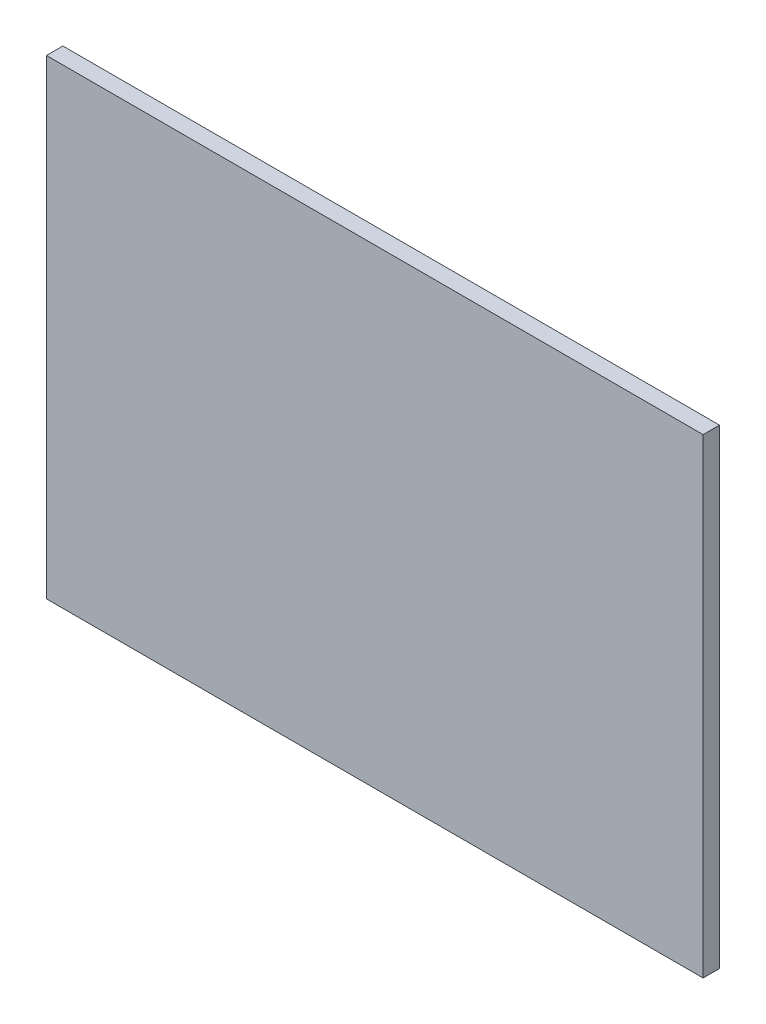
ISO-10303-21;
HEADER;
FILE_DESCRIPTION(('STEP AP214'),'2;1');
FILE_NAME('part.step','',(''),(''),'','','');
FILE_SCHEMA(('AUTOMOTIVE_DESIGN { 1 0 10303 214 1 1 1 1 }'));
ENDSEC;
DATA;
#1=APPLICATION_CONTEXT('core data for automotive mechanical design processes');
#2=APPLICATION_PROTOCOL_DEFINITION('international standard','automotive_design',2000,#1);
#3=PRODUCT_CONTEXT('',#1,'mechanical');
#4=PRODUCT('Part','Part','',(#3));
#5=PRODUCT_RELATED_PRODUCT_CATEGORY('part','',(#4));
#6=PRODUCT_DEFINITION_FORMATION('','',#4);
#7=PRODUCT_DEFINITION_CONTEXT('part definition',#1,'design');
#8=PRODUCT_DEFINITION('design','',#6,#7);
#9=PRODUCT_DEFINITION_SHAPE('','',#8);
#10=(LENGTH_UNIT() NAMED_UNIT(*) SI_UNIT(.MILLI.,.METRE.));
#11=(NAMED_UNIT(*) PLANE_ANGLE_UNIT() SI_UNIT($,.RADIAN.));
#12=(NAMED_UNIT(*) SI_UNIT($,.STERADIAN.) SOLID_ANGLE_UNIT());
#13=UNCERTAINTY_MEASURE_WITH_UNIT(LENGTH_MEASURE(1.E-05),#10,'distance_accuracy_value','');
#14=(GEOMETRIC_REPRESENTATION_CONTEXT(3) GLOBAL_UNCERTAINTY_ASSIGNED_CONTEXT((#13)) GLOBAL_UNIT_ASSIGNED_CONTEXT((#10,
#11,#12)) REPRESENTATION_CONTEXT('',''));
#15=CARTESIAN_POINT('',(0.,0.,0.));
#16=DIRECTION('',(0.,0.,1.));
#17=DIRECTION('',(1.,0.,0.));
#18=AXIS2_PLACEMENT_3D('',#15,#16,#17);
#19=CARTESIAN_POINT('',(300.,215.,15.));
#20=DIRECTION('',(-1.,0.,0.));
#21=DIRECTION('',(0.,-1.,0.));
#22=AXIS2_PLACEMENT_3D('',#19,#20,#21);
#23=PLANE('',#22);
#24=DIRECTION('',(0.,1.,0.));
#25=VECTOR('',#24,1.);
#26=CARTESIAN_POINT('',(300.,215.,0.));
#27=LINE('',#26,#25);
#28=CARTESIAN_POINT('',(300.,-215.,0.));
#29=VERTEX_POINT('',#28);
#30=CARTESIAN_POINT('',(300.,215.,0.));
#31=VERTEX_POINT('',#30);
#32=EDGE_CURVE('E111',#29,#31,#27,.T.);
#33=ORIENTED_EDGE('',*,*,#32,.T.);
#34=DIRECTION('',(0.,0.,-1.));
#35=VECTOR('',#34,1.);
#36=CARTESIAN_POINT('',(300.,215.,15.));
#37=LINE('',#36,#35);
#38=CARTESIAN_POINT('',(300.,215.,15.));
#39=VERTEX_POINT('',#38);
#40=EDGE_CURVE('E11',#39,#31,#37,.T.);
#41=ORIENTED_EDGE('',*,*,#40,.F.);
#42=DIRECTION('',(0.,1.,0.));
#43=VECTOR('',#42,1.);
#44=CARTESIAN_POINT('',(300.,215.,15.));
#45=LINE('',#44,#43);
#46=CARTESIAN_POINT('',(300.,-215.,15.));
#47=VERTEX_POINT('',#46);
#48=EDGE_CURVE('E95',#47,#39,#45,.T.);
#49=ORIENTED_EDGE('',*,*,#48,.F.);
#50=DIRECTION('',(0.,0.,-1.));
#51=VECTOR('',#50,1.);
#52=CARTESIAN_POINT('',(300.,-215.,15.));
#53=LINE('',#52,#51);
#54=EDGE_CURVE('E107',#47,#29,#53,.T.);
#55=ORIENTED_EDGE('',*,*,#54,.T.);
#56=EDGE_LOOP('',(#33,#41,#49,#55));
#57=FACE_BOUND('',#56,.T.);
#58=ADVANCED_FACE('F43',(#57),#23,.F.);
#59=CARTESIAN_POINT('',(-300.,215.,15.));
#60=DIRECTION('',(0.,-1.,0.));
#61=DIRECTION('',(0.,0.,-1.));
#62=AXIS2_PLACEMENT_3D('',#59,#60,#61);
#63=PLANE('',#62);
#64=DIRECTION('',(-1.,0.,0.));
#65=VECTOR('',#64,1.);
#66=CARTESIAN_POINT('',(-300.,215.,0.));
#67=LINE('',#66,#65);
#68=CARTESIAN_POINT('',(-300.,215.,0.));
#69=VERTEX_POINT('',#68);
#70=EDGE_CURVE('E100',#31,#69,#67,.T.);
#71=ORIENTED_EDGE('',*,*,#70,.T.);
#72=DIRECTION('',(0.,0.,-1.));
#73=VECTOR('',#72,1.);
#74=CARTESIAN_POINT('',(-300.,215.,15.));
#75=LINE('',#74,#73);
#76=CARTESIAN_POINT('',(-300.,215.,15.));
#77=VERTEX_POINT('',#76);
#78=EDGE_CURVE('E52',#77,#69,#75,.T.);
#79=ORIENTED_EDGE('',*,*,#78,.F.);
#80=DIRECTION('',(-1.,0.,0.));
#81=VECTOR('',#80,1.);
#82=CARTESIAN_POINT('',(-300.,215.,15.));
#83=LINE('',#82,#81);
#84=EDGE_CURVE('E90',#39,#77,#83,.T.);
#85=ORIENTED_EDGE('',*,*,#84,.F.);
#86=ORIENTED_EDGE('',*,*,#40,.T.);
#87=EDGE_LOOP('',(#71,#79,#85,#86));
#88=FACE_BOUND('',#87,.T.);
#89=ADVANCED_FACE('F99',(#88),#63,.F.);
#90=CARTESIAN_POINT('',(-300.,215.,15.));
#91=DIRECTION('',(1.,0.,0.));
#92=DIRECTION('',(0.,0.,-1.));
#93=AXIS2_PLACEMENT_3D('',#90,#91,#92);
#94=PLANE('',#93);
#95=DIRECTION('',(0.,-1.,0.));
#96=VECTOR('',#95,1.);
#97=CARTESIAN_POINT('',(-300.,215.,0.));
#98=LINE('',#97,#96);
#99=CARTESIAN_POINT('',(-300.,-215.,0.));
#100=VERTEX_POINT('',#99);
#101=EDGE_CURVE('E77',#69,#100,#98,.T.);
#102=ORIENTED_EDGE('',*,*,#101,.T.);
#103=DIRECTION('',(0.,0.,-1.));
#104=VECTOR('',#103,1.);
#105=CARTESIAN_POINT('',(-300.,-215.,15.));
#106=LINE('',#105,#104);
#107=CARTESIAN_POINT('',(-300.,-215.,15.));
#108=VERTEX_POINT('',#107);
#109=EDGE_CURVE('E102',#108,#100,#106,.T.);
#110=ORIENTED_EDGE('',*,*,#109,.F.);
#111=DIRECTION('',(0.,-1.,0.));
#112=VECTOR('',#111,1.);
#113=CARTESIAN_POINT('',(-300.,215.,15.));
#114=LINE('',#113,#112);
#115=EDGE_CURVE('E93',#77,#108,#114,.T.);
#116=ORIENTED_EDGE('',*,*,#115,.F.);
#117=ORIENTED_EDGE('',*,*,#78,.T.);
#118=EDGE_LOOP('',(#102,#110,#116,#117));
#119=FACE_BOUND('',#118,.T.);
#120=ADVANCED_FACE('F103',(#119),#94,.F.);
#121=CARTESIAN_POINT('',(-300.,-215.,15.));
#122=DIRECTION('',(0.,1.,0.));
#123=DIRECTION('',(0.,0.,1.));
#124=AXIS2_PLACEMENT_3D('',#121,#122,#123);
#125=PLANE('',#124);
#126=DIRECTION('',(1.,0.,0.));
#127=VECTOR('',#126,1.);
#128=CARTESIAN_POINT('',(-300.,-215.,0.));
#129=LINE('',#128,#127);
#130=EDGE_CURVE('E83',#100,#29,#129,.T.);
#131=ORIENTED_EDGE('',*,*,#130,.T.);
#132=ORIENTED_EDGE('',*,*,#54,.F.);
#133=DIRECTION('',(1.,0.,0.));
#134=VECTOR('',#133,1.);
#135=CARTESIAN_POINT('',(-300.,-215.,15.));
#136=LINE('',#135,#134);
#137=EDGE_CURVE('E60',#108,#47,#136,.T.);
#138=ORIENTED_EDGE('',*,*,#137,.F.);
#139=ORIENTED_EDGE('',*,*,#109,.T.);
#140=EDGE_LOOP('',(#131,#132,#138,#139));
#141=FACE_BOUND('',#140,.T.);
#142=ADVANCED_FACE('F124',(#141),#125,.F.);
#143=CARTESIAN_POINT('',(0.,0.,15.));
#144=DIRECTION('',(0.,0.,1.));
#145=DIRECTION('',(1.,0.,0.));
#146=AXIS2_PLACEMENT_3D('',#143,#144,#145);
#147=PLANE('',#146);
#148=ORIENTED_EDGE('',*,*,#48,.T.);
#149=ORIENTED_EDGE('',*,*,#84,.T.);
#150=ORIENTED_EDGE('',*,*,#115,.T.);
#151=ORIENTED_EDGE('',*,*,#137,.T.);
#152=EDGE_LOOP('',(#148,#149,#150,#151));
#153=FACE_BOUND('',#152,.T.);
#154=ADVANCED_FACE('F91',(#153),#147,.T.);
#155=CARTESIAN_POINT('',(0.,0.,0.));
#156=DIRECTION('',(0.,0.,1.));
#157=DIRECTION('',(1.,0.,0.));
#158=AXIS2_PLACEMENT_3D('',#155,#156,#157);
#159=PLANE('',#158);
#160=ORIENTED_EDGE('',*,*,#32,.F.);
#161=ORIENTED_EDGE('',*,*,#130,.F.);
#162=ORIENTED_EDGE('',*,*,#101,.F.);
#163=ORIENTED_EDGE('',*,*,#70,.F.);
#164=EDGE_LOOP('',(#160,#161,#162,#163));
#165=FACE_BOUND('',#164,.T.);
#166=ADVANCED_FACE('F127',(#165),#159,.F.);
#167=CLOSED_SHELL('',(#58,#89,#120,#142,#154,#166));
#168=MANIFOLD_SOLID_BREP('B2',#167);
#169=ADVANCED_BREP_SHAPE_REPRESENTATION('',(#18,#168),#14);
#170=SHAPE_DEFINITION_REPRESENTATION(#9,#169);
ENDSEC;
END-ISO-10303-21;
